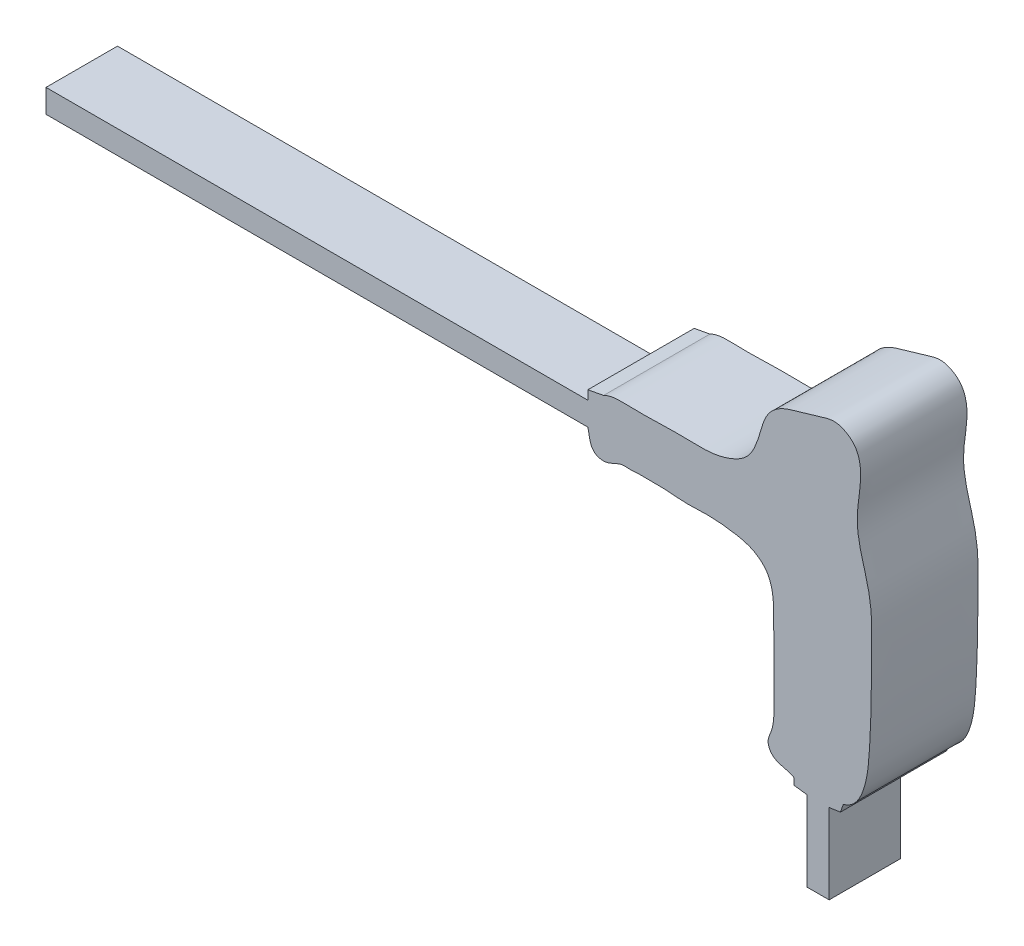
ISO-10303-21;
HEADER;
FILE_DESCRIPTION(('STEP AP214'),'2;1');
FILE_NAME('part.step','',(''),(''),'','','');
FILE_SCHEMA(('AUTOMOTIVE_DESIGN { 1 0 10303 214 1 1 1 1 }'));
ENDSEC;
DATA;
#1=APPLICATION_CONTEXT('core data for automotive mechanical design processes');
#2=APPLICATION_PROTOCOL_DEFINITION('international standard','automotive_design',2000,#1);
#3=PRODUCT_CONTEXT('',#1,'mechanical');
#4=PRODUCT('Part','Part','',(#3));
#5=PRODUCT_RELATED_PRODUCT_CATEGORY('part','',(#4));
#6=PRODUCT_DEFINITION_FORMATION('','',#4);
#7=PRODUCT_DEFINITION_CONTEXT('part definition',#1,'design');
#8=PRODUCT_DEFINITION('design','',#6,#7);
#9=PRODUCT_DEFINITION_SHAPE('','',#8);
#10=(LENGTH_UNIT() NAMED_UNIT(*) SI_UNIT(.MILLI.,.METRE.));
#11=(NAMED_UNIT(*) PLANE_ANGLE_UNIT() SI_UNIT($,.RADIAN.));
#12=(NAMED_UNIT(*) SI_UNIT($,.STERADIAN.) SOLID_ANGLE_UNIT());
#13=UNCERTAINTY_MEASURE_WITH_UNIT(LENGTH_MEASURE(1.E-05),#10,'distance_accuracy_value','');
#14=(GEOMETRIC_REPRESENTATION_CONTEXT(3) GLOBAL_UNCERTAINTY_ASSIGNED_CONTEXT((#13)) GLOBAL_UNIT_ASSIGNED_CONTEXT((#10,
#11,#12)) REPRESENTATION_CONTEXT('',''));
#15=CARTESIAN_POINT('',(0.,0.,0.));
#16=DIRECTION('',(0.,0.,1.));
#17=DIRECTION('',(1.,0.,0.));
#18=AXIS2_PLACEMENT_3D('',#15,#16,#17);
#19=CARTESIAN_POINT('',(132.530146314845,12.8255846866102,-8.7));
#20=DIRECTION('',(1.,0.,0.));
#21=DIRECTION('',(0.,0.,-1.));
#22=AXIS2_PLACEMENT_3D('',#19,#20,#21);
#23=PLANE('',#22);
#24=DIRECTION('',(0.,0.,1.));
#25=VECTOR('',#24,1.);
#26=CARTESIAN_POINT('',(132.530146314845,-0.274304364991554,-8.7));
#27=LINE('',#26,#25);
#28=CARTESIAN_POINT('',(132.530146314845,-0.274304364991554,-3.));
#29=VERTEX_POINT('',#28);
#30=CARTESIAN_POINT('',(132.530146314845,-0.274304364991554,8.7));
#31=VERTEX_POINT('',#30);
#32=EDGE_CURVE('E191',#29,#31,#27,.T.);
#33=ORIENTED_EDGE('',*,*,#32,.F.);
#34=DIRECTION('',(0.,-1.,0.));
#35=VECTOR('',#34,1.);
#36=CARTESIAN_POINT('',(132.530146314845,-0.274304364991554,-3.));
#37=LINE('',#36,#35);
#38=CARTESIAN_POINT('',(132.530146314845,12.8255846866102,-3.));
#39=VERTEX_POINT('',#38);
#40=EDGE_CURVE('E160',#39,#29,#37,.T.);
#41=ORIENTED_EDGE('',*,*,#40,.F.);
#42=DIRECTION('',(0.,0.,1.));
#43=VECTOR('',#42,1.);
#44=CARTESIAN_POINT('',(132.530146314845,12.8255846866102,-8.7));
#45=LINE('',#44,#43);
#46=CARTESIAN_POINT('',(132.530146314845,12.8255846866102,8.7));
#47=VERTEX_POINT('',#46);
#48=EDGE_CURVE('E390',#39,#47,#45,.T.);
#49=ORIENTED_EDGE('',*,*,#48,.T.);
#50=DIRECTION('',(0.,1.,0.));
#51=VECTOR('',#50,1.);
#52=CARTESIAN_POINT('',(132.530146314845,12.8255846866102,8.7));
#53=LINE('',#52,#51);
#54=EDGE_CURVE('E272',#31,#47,#53,.T.);
#55=ORIENTED_EDGE('',*,*,#54,.F.);
#56=EDGE_LOOP('',(#33,#41,#49,#55));
#57=FACE_BOUND('',#56,.T.);
#58=ADVANCED_FACE('F39',(#57),#23,.T.);
#59=CARTESIAN_POINT('',(132.530146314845,-0.274304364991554,-8.7));
#60=DIRECTION('',(0.,-1.,0.));
#61=DIRECTION('',(0.,0.,-1.));
#62=AXIS2_PLACEMENT_3D('',#59,#60,#61);
#63=PLANE('',#62);
#64=DIRECTION('',(0.,0.,1.));
#65=VECTOR('',#64,1.);
#66=CARTESIAN_POINT('',(128.905366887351,-0.274304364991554,-8.7));
#67=LINE('',#66,#65);
#68=CARTESIAN_POINT('',(128.905366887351,-0.274304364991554,-3.));
#69=VERTEX_POINT('',#68);
#70=CARTESIAN_POINT('',(128.905366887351,-0.274304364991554,8.7));
#71=VERTEX_POINT('',#70);
#72=EDGE_CURVE('E189',#69,#71,#67,.T.);
#73=ORIENTED_EDGE('',*,*,#72,.F.);
#74=DIRECTION('',(-1.,0.,0.));
#75=VECTOR('',#74,1.);
#76=CARTESIAN_POINT('',(128.905366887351,-0.274304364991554,-3.));
#77=LINE('',#76,#75);
#78=EDGE_CURVE('E167',#29,#69,#77,.T.);
#79=ORIENTED_EDGE('',*,*,#78,.F.);
#80=ORIENTED_EDGE('',*,*,#32,.T.);
#81=DIRECTION('',(1.,0.,0.));
#82=VECTOR('',#81,1.);
#83=CARTESIAN_POINT('',(132.530146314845,-0.274304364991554,8.7));
#84=LINE('',#83,#82);
#85=EDGE_CURVE('E268',#71,#31,#84,.T.);
#86=ORIENTED_EDGE('',*,*,#85,.F.);
#87=EDGE_LOOP('',(#73,#79,#80,#86));
#88=FACE_BOUND('',#87,.T.);
#89=ADVANCED_FACE('F339',(#88),#63,.T.);
#90=CARTESIAN_POINT('',(128.905366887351,-0.274304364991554,-8.7));
#91=DIRECTION('',(-1.,0.,0.));
#92=DIRECTION('',(0.,0.,1.));
#93=AXIS2_PLACEMENT_3D('',#90,#91,#92);
#94=PLANE('',#93);
#95=DIRECTION('',(0.,0.,1.));
#96=VECTOR('',#95,1.);
#97=CARTESIAN_POINT('',(128.905366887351,12.8255846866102,-8.7));
#98=LINE('',#97,#96);
#99=CARTESIAN_POINT('',(128.905366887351,12.8255846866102,-3.));
#100=VERTEX_POINT('',#99);
#101=CARTESIAN_POINT('',(128.905366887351,12.8255846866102,8.7));
#102=VERTEX_POINT('',#101);
#103=EDGE_CURVE('E174',#100,#102,#98,.T.);
#104=ORIENTED_EDGE('',*,*,#103,.F.);
#105=DIRECTION('',(0.,1.,0.));
#106=VECTOR('',#105,1.);
#107=CARTESIAN_POINT('',(128.905366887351,-0.274304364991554,-3.));
#108=LINE('',#107,#106);
#109=EDGE_CURVE('E161',#69,#100,#108,.T.);
#110=ORIENTED_EDGE('',*,*,#109,.F.);
#111=ORIENTED_EDGE('',*,*,#72,.T.);
#112=DIRECTION('',(0.,-1.,0.));
#113=VECTOR('',#112,1.);
#114=CARTESIAN_POINT('',(128.905366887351,-0.274304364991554,8.7));
#115=LINE('',#114,#113);
#116=EDGE_CURVE('E177',#102,#71,#115,.T.);
#117=ORIENTED_EDGE('',*,*,#116,.F.);
#118=EDGE_LOOP('',(#104,#110,#111,#117));
#119=FACE_BOUND('',#118,.T.);
#120=ADVANCED_FACE('F175',(#119),#94,.T.);
#121=CARTESIAN_POINT('',(93.0465953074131,50.8082638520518,-8.7));
#122=DIRECTION('',(-1.,0.,0.));
#123=DIRECTION('',(0.,0.,1.));
#124=AXIS2_PLACEMENT_3D('',#121,#122,#123);
#125=PLANE('',#124);
#126=DIRECTION('',(0.,-1.,0.));
#127=VECTOR('',#126,1.);
#128=CARTESIAN_POINT('',(93.0465953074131,50.8082638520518,-8.7));
#129=LINE('',#128,#127);
#130=CARTESIAN_POINT('',(93.0465953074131,52.2991390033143,-8.7));
#131=VERTEX_POINT('',#130);
#132=CARTESIAN_POINT('',(93.0465953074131,46.9889523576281,-8.7));
#133=VERTEX_POINT('',#132);
#134=EDGE_CURVE('E297',#131,#133,#129,.T.);
#135=ORIENTED_EDGE('',*,*,#134,.T.);
#136=DIRECTION('',(0.,0.,1.));
#137=VECTOR('',#136,1.);
#138=CARTESIAN_POINT('',(93.0465953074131,46.9889523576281,-8.7));
#139=LINE('',#138,#137);
#140=CARTESIAN_POINT('',(93.0465953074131,46.9889523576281,-3.));
#141=VERTEX_POINT('',#140);
#142=EDGE_CURVE('E200',#133,#141,#139,.T.);
#143=ORIENTED_EDGE('',*,*,#142,.T.);
#144=DIRECTION('',(0.,-1.,0.));
#145=VECTOR('',#144,1.);
#146=CARTESIAN_POINT('',(93.0465953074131,50.8082638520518,-3.));
#147=LINE('',#146,#145);
#148=CARTESIAN_POINT('',(93.0465953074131,50.8082638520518,-3.));
#149=VERTEX_POINT('',#148);
#150=EDGE_CURVE('E212',#149,#141,#147,.T.);
#151=ORIENTED_EDGE('',*,*,#150,.F.);
#152=DIRECTION('',(0.,0.,1.));
#153=VECTOR('',#152,1.);
#154=CARTESIAN_POINT('',(93.0465953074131,50.8082638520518,-8.7));
#155=LINE('',#154,#153);
#156=CARTESIAN_POINT('',(93.0465953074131,50.8082638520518,8.7));
#157=VERTEX_POINT('',#156);
#158=EDGE_CURVE('E552',#149,#157,#155,.T.);
#159=ORIENTED_EDGE('',*,*,#158,.T.);
#160=DIRECTION('',(0.,-1.,0.));
#161=VECTOR('',#160,1.);
#162=CARTESIAN_POINT('',(93.0465953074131,50.8082638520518,8.7));
#163=LINE('',#162,#161);
#164=CARTESIAN_POINT('',(93.0465953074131,52.2991390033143,8.7));
#165=VERTEX_POINT('',#164);
#166=EDGE_CURVE('E234',#165,#157,#163,.T.);
#167=ORIENTED_EDGE('',*,*,#166,.F.);
#168=DIRECTION('',(0.,0.,1.));
#169=VECTOR('',#168,1.);
#170=CARTESIAN_POINT('',(93.0465953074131,52.2991390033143,-8.7));
#171=LINE('',#170,#169);
#172=EDGE_CURVE('E11',#131,#165,#171,.T.);
#173=ORIENTED_EDGE('',*,*,#172,.F.);
#174=EDGE_LOOP('',(#135,#143,#151,#159,#167,#173));
#175=FACE_BOUND('',#174,.T.);
#176=ADVANCED_FACE('F41',(#175),#125,.T.);
#177=CARTESIAN_POINT('',(93.0465953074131,52.2991390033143,-8.7));
#178=DIRECTION('',(-0.182542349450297,0.983197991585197,0.));
#179=DIRECTION('',(-0.983197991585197,-0.182542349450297,0.));
#180=AXIS2_PLACEMENT_3D('',#177,#178,#179);
#181=PLANE('',#180);
#182=ORIENTED_EDGE('',*,*,#172,.T.);
#183=DIRECTION('',(-0.983197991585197,-0.182542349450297,0.));
#184=VECTOR('',#183,1.);
#185=CARTESIAN_POINT('',(93.0465953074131,52.2991390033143,8.7));
#186=LINE('',#185,#184);
#187=CARTESIAN_POINT('',(95.6109997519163,52.7752510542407,8.7));
#188=VERTEX_POINT('',#187);
#189=EDGE_CURVE('E290',#188,#165,#186,.T.);
#190=ORIENTED_EDGE('',*,*,#189,.F.);
#191=DIRECTION('',(0.,0.,1.));
#192=VECTOR('',#191,1.);
#193=CARTESIAN_POINT('',(95.6109997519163,52.7752510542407,-8.7));
#194=LINE('',#193,#192);
#195=CARTESIAN_POINT('',(95.6109997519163,52.7752510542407,-8.7));
#196=VERTEX_POINT('',#195);
#197=EDGE_CURVE('E49',#196,#188,#194,.T.);
#198=ORIENTED_EDGE('',*,*,#197,.F.);
#199=DIRECTION('',(-0.983197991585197,-0.182542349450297,0.));
#200=VECTOR('',#199,1.);
#201=CARTESIAN_POINT('',(93.0465953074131,52.2991390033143,-8.7));
#202=LINE('',#201,#200);
#203=EDGE_CURVE('E406',#196,#131,#202,.T.);
#204=ORIENTED_EDGE('',*,*,#203,.T.);
#205=EDGE_LOOP('',(#182,#190,#198,#204));
#206=FACE_BOUND('',#205,.T.);
#207=ADVANCED_FACE('F413',(#206),#181,.T.);
#208=CARTESIAN_POINT('',(134.848525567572,14.440362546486,-8.7));
#209=CARTESIAN_POINT('',(136.736418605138,14.9231028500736,-8.7));
#210=CARTESIAN_POINT('',(138.623598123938,18.4056818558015,-8.7));
#211=CARTESIAN_POINT('',(139.100680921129,23.2563938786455,-8.7));
#212=CARTESIAN_POINT('',(139.320359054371,27.9325311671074,-8.7));
#213=CARTESIAN_POINT('',(139.444391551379,31.9067017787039,-8.7));
#214=CARTESIAN_POINT('',(139.496456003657,35.6067360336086,-8.7));
#215=CARTESIAN_POINT('',(139.468211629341,39.4871015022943,-8.7));
#216=CARTESIAN_POINT('',(139.592453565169,43.3374849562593,-8.7));
#217=CARTESIAN_POINT('',(138.865216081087,47.8353164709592,-8.7));
#218=CARTESIAN_POINT('',(137.632338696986,51.5474413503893,-8.7));
#219=CARTESIAN_POINT('',(137.045514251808,55.201682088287,-8.7));
#220=CARTESIAN_POINT('',(137.241655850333,58.4165321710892,-8.7));
#221=CARTESIAN_POINT('',(137.7295378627,61.2582600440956,-8.7));
#222=CARTESIAN_POINT('',(137.710800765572,64.0220703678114,-8.7));
#223=CARTESIAN_POINT('',(136.95698982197,66.2019911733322,-8.7));
#224=CARTESIAN_POINT('',(135.406949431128,67.4316193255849,-8.7));
#225=CARTESIAN_POINT('',(133.228213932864,68.2713814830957,-8.7));
#226=CARTESIAN_POINT('',(130.144484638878,67.0579983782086,-8.7));
#227=CARTESIAN_POINT('',(126.755424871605,66.3552633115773,-8.7));
#228=CARTESIAN_POINT('',(123.763996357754,65.1154411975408,-8.7));
#229=CARTESIAN_POINT('',(122.085552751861,63.1402459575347,-8.7));
#230=CARTESIAN_POINT('',(121.332411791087,60.6562044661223,-8.7));
#231=CARTESIAN_POINT('',(120.606811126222,58.1322659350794,-8.7));
#232=CARTESIAN_POINT('',(119.154303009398,55.5654643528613,-8.7));
#233=CARTESIAN_POINT('',(116.520614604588,54.1283674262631,-8.7));
#234=CARTESIAN_POINT('',(113.776029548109,53.4373210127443,-8.7));
#235=CARTESIAN_POINT('',(111.067538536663,53.3382037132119,-8.7));
#236=CARTESIAN_POINT('',(108.109736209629,53.4571462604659,-8.7));
#237=CARTESIAN_POINT('',(104.586961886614,53.3764639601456,-8.7));
#238=CARTESIAN_POINT('',(101.462662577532,53.2757603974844,-8.7));
#239=CARTESIAN_POINT('',(98.4573744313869,53.4141349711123,-8.7));
#240=CARTESIAN_POINT('',(96.6821018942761,53.3519944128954,-8.7));
#241=CARTESIAN_POINT('',(95.6109997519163,52.7752510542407,-8.7));
#242=B_SPLINE_CURVE_WITH_KNOTS('',3,(#208,#209,#210,#211,#212,#213,#214,#215,#216,#217,#218,
#219,#220,#221,#222,#223,#224,#225,#226,#227,#228,#229,#230,#231,#232,#233,#234,#235,#236,#237,
#238,#239,#240,#241),.UNSPECIFIED.,.F.,.F.,(4,1,1,1,1,1,1,1,1,1,1,1,1,1,1,1,1,1,1,1,1,1,1,1,1,1,
1,1,1,1,1,4),(0.,0.0523924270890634,0.10750471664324,0.143602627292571,0.18989517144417,
0.22440272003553,0.252343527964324,0.304008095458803,0.337268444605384,0.385616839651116,
0.418863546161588,0.445230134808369,0.479903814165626,0.503452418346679,0.526173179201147,
0.544610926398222,0.559970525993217,0.592568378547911,0.635826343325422,0.664197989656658,
0.685191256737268,0.709577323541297,0.73964049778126,0.762776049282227,0.793903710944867,
0.824225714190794,0.845716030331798,0.873243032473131,0.911265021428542,0.949287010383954,
0.964921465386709,1.),.UNSPECIFIED.);
#243=DIRECTION('',(0.,0.,1.));
#244=VECTOR('',#243,1.);
#245=SURFACE_OF_LINEAR_EXTRUSION('',#242,#244);
#246=ORIENTED_EDGE('',*,*,#197,.T.);
#247=CARTESIAN_POINT('',(134.848525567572,14.440362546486,8.7));
#248=CARTESIAN_POINT('',(136.736418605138,14.9231028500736,8.7));
#249=CARTESIAN_POINT('',(138.623598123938,18.4056818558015,8.7));
#250=CARTESIAN_POINT('',(139.100680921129,23.2563938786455,8.7));
#251=CARTESIAN_POINT('',(139.320359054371,27.9325311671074,8.7));
#252=CARTESIAN_POINT('',(139.444391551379,31.9067017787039,8.7));
#253=CARTESIAN_POINT('',(139.496456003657,35.6067360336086,8.7));
#254=CARTESIAN_POINT('',(139.468211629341,39.4871015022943,8.7));
#255=CARTESIAN_POINT('',(139.592453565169,43.3374849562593,8.7));
#256=CARTESIAN_POINT('',(138.865216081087,47.8353164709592,8.7));
#257=CARTESIAN_POINT('',(137.632338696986,51.5474413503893,8.7));
#258=CARTESIAN_POINT('',(137.045514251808,55.201682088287,8.7));
#259=CARTESIAN_POINT('',(137.241655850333,58.4165321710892,8.7));
#260=CARTESIAN_POINT('',(137.7295378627,61.2582600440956,8.7));
#261=CARTESIAN_POINT('',(137.710800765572,64.0220703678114,8.7));
#262=CARTESIAN_POINT('',(136.95698982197,66.2019911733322,8.7));
#263=CARTESIAN_POINT('',(135.406949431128,67.4316193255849,8.7));
#264=CARTESIAN_POINT('',(133.228213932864,68.2713814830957,8.7));
#265=CARTESIAN_POINT('',(130.144484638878,67.0579983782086,8.7));
#266=CARTESIAN_POINT('',(126.755424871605,66.3552633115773,8.7));
#267=CARTESIAN_POINT('',(123.763996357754,65.1154411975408,8.7));
#268=CARTESIAN_POINT('',(122.085552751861,63.1402459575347,8.7));
#269=CARTESIAN_POINT('',(121.332411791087,60.6562044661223,8.7));
#270=CARTESIAN_POINT('',(120.606811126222,58.1322659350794,8.7));
#271=CARTESIAN_POINT('',(119.154303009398,55.5654643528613,8.7));
#272=CARTESIAN_POINT('',(116.520614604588,54.1283674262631,8.7));
#273=CARTESIAN_POINT('',(113.776029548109,53.4373210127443,8.7));
#274=CARTESIAN_POINT('',(111.067538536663,53.3382037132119,8.7));
#275=CARTESIAN_POINT('',(108.109736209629,53.4571462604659,8.7));
#276=CARTESIAN_POINT('',(104.586961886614,53.3764639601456,8.7));
#277=CARTESIAN_POINT('',(101.462662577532,53.2757603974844,8.7));
#278=CARTESIAN_POINT('',(98.4573744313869,53.4141349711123,8.7));
#279=CARTESIAN_POINT('',(96.6821018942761,53.3519944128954,8.7));
#280=CARTESIAN_POINT('',(95.6109997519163,52.7752510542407,8.7));
#281=B_SPLINE_CURVE_WITH_KNOTS('',3,(#247,#248,#249,#250,#251,#252,#253,#254,#255,#256,#257,
#258,#259,#260,#261,#262,#263,#264,#265,#266,#267,#268,#269,#270,#271,#272,#273,#274,#275,#276,
#277,#278,#279,#280),.UNSPECIFIED.,.F.,.F.,(4,1,1,1,1,1,1,1,1,1,1,1,1,1,1,1,1,1,1,1,1,1,1,1,1,1,
1,1,1,1,1,4),(0.,0.0523924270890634,0.10750471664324,0.143602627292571,0.18989517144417,
0.22440272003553,0.252343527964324,0.304008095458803,0.337268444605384,0.385616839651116,
0.418863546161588,0.445230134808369,0.479903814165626,0.503452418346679,0.526173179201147,
0.544610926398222,0.559970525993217,0.592568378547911,0.635826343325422,0.664197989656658,
0.685191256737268,0.709577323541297,0.73964049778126,0.762776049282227,0.793903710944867,
0.824225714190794,0.845716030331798,0.873243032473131,0.911265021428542,0.949287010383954,
0.964921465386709,1.),.UNSPECIFIED.);
#282=CARTESIAN_POINT('',(134.848525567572,14.440362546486,8.7));
#283=VERTEX_POINT('',#282);
#284=EDGE_CURVE('E284',#283,#188,#281,.T.);
#285=ORIENTED_EDGE('',*,*,#284,.F.);
#286=DIRECTION('',(0.,0.,1.));
#287=VECTOR('',#286,1.);
#288=CARTESIAN_POINT('',(134.848525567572,14.440362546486,-8.7));
#289=LINE('',#288,#287);
#290=CARTESIAN_POINT('',(134.848525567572,14.440362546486,-8.7));
#291=VERTEX_POINT('',#290);
#292=EDGE_CURVE('E376',#291,#283,#289,.T.);
#293=ORIENTED_EDGE('',*,*,#292,.F.);
#294=EDGE_CURVE('E398',#291,#196,#242,.T.);
#295=ORIENTED_EDGE('',*,*,#294,.T.);
#296=EDGE_LOOP('',(#246,#285,#293,#295));
#297=FACE_BOUND('',#296,.T.);
#298=ADVANCED_FACE('F364',(#297),#245,.T.);
#299=CARTESIAN_POINT('',(134.848525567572,14.440362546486,-8.7));
#300=DIRECTION('',(0.944419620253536,-0.328742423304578,0.));
#301=DIRECTION('',(0.328742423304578,0.944419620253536,0.));
#302=AXIS2_PLACEMENT_3D('',#299,#300,#301);
#303=PLANE('',#302);
#304=ORIENTED_EDGE('',*,*,#292,.T.);
#305=DIRECTION('',(0.328742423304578,0.944419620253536,0.));
#306=VECTOR('',#305,1.);
#307=CARTESIAN_POINT('',(134.848525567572,14.440362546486,8.7));
#308=LINE('',#307,#306);
#309=CARTESIAN_POINT('',(134.379617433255,13.0932712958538,8.7));
#310=VERTEX_POINT('',#309);
#311=EDGE_CURVE('E280',#310,#283,#308,.T.);
#312=ORIENTED_EDGE('',*,*,#311,.F.);
#313=DIRECTION('',(0.,0.,1.));
#314=VECTOR('',#313,1.);
#315=CARTESIAN_POINT('',(134.379617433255,13.0932712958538,-8.7));
#316=LINE('',#315,#314);
#317=CARTESIAN_POINT('',(134.379617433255,13.0932712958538,-8.7));
#318=VERTEX_POINT('',#317);
#319=EDGE_CURVE('E368',#318,#310,#316,.T.);
#320=ORIENTED_EDGE('',*,*,#319,.F.);
#321=DIRECTION('',(0.328742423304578,0.944419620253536,0.));
#322=VECTOR('',#321,1.);
#323=CARTESIAN_POINT('',(134.848525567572,14.440362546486,-8.7));
#324=LINE('',#323,#322);
#325=EDGE_CURVE('E381',#318,#291,#324,.T.);
#326=ORIENTED_EDGE('',*,*,#325,.T.);
#327=EDGE_LOOP('',(#304,#312,#320,#326));
#328=FACE_BOUND('',#327,.T.);
#329=ADVANCED_FACE('F359',(#328),#303,.T.);
#330=CARTESIAN_POINT('',(134.379617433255,13.0932712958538,-8.7));
#331=DIRECTION('',(0.143244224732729,-0.989687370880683,0.));
#332=DIRECTION('',(0.989687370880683,0.143244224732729,0.));
#333=AXIS2_PLACEMENT_3D('',#330,#331,#332);
#334=PLANE('',#333);
#335=ORIENTED_EDGE('',*,*,#319,.T.);
#336=DIRECTION('',(0.989687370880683,0.143244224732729,0.));
#337=VECTOR('',#336,1.);
#338=CARTESIAN_POINT('',(134.379617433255,13.0932712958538,8.7));
#339=LINE('',#338,#337);
#340=EDGE_CURVE('E276',#47,#310,#339,.T.);
#341=ORIENTED_EDGE('',*,*,#340,.F.);
#342=ORIENTED_EDGE('',*,*,#48,.F.);
#343=CARTESIAN_POINT('',(132.530146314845,12.8255846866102,-8.7));
#344=VERTEX_POINT('',#343);
#345=EDGE_CURVE('E156',#344,#39,#45,.T.);
#346=ORIENTED_EDGE('',*,*,#345,.F.);
#347=DIRECTION('',(0.989687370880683,0.143244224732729,0.));
#348=VECTOR('',#347,1.);
#349=CARTESIAN_POINT('',(134.379617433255,13.0932712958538,-8.7));
#350=LINE('',#349,#348);
#351=EDGE_CURVE('E371',#344,#318,#350,.T.);
#352=ORIENTED_EDGE('',*,*,#351,.T.);
#353=EDGE_LOOP('',(#335,#341,#342,#346,#352));
#354=FACE_BOUND('',#353,.T.);
#355=ADVANCED_FACE('F349',(#354),#334,.T.);
#356=CARTESIAN_POINT('',(128.905366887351,12.8255846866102,-8.7));
#357=DIRECTION('',(-0.124215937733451,-0.992255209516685,0.));
#358=DIRECTION('',(0.992255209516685,-0.124215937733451,0.));
#359=AXIS2_PLACEMENT_3D('',#356,#357,#358);
#360=PLANE('',#359);
#361=CARTESIAN_POINT('',(128.905366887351,12.8255846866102,-8.7));
#362=VERTEX_POINT('',#361);
#363=EDGE_CURVE('E153',#362,#100,#98,.T.);
#364=ORIENTED_EDGE('',*,*,#363,.T.);
#365=ORIENTED_EDGE('',*,*,#103,.T.);
#366=DIRECTION('',(0.992255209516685,-0.124215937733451,0.));
#367=VECTOR('',#366,1.);
#368=CARTESIAN_POINT('',(128.905366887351,12.8255846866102,8.7));
#369=LINE('',#368,#367);
#370=CARTESIAN_POINT('',(126.767046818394,13.0932712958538,8.7));
#371=VERTEX_POINT('',#370);
#372=EDGE_CURVE('E263',#371,#102,#369,.T.);
#373=ORIENTED_EDGE('',*,*,#372,.F.);
#374=DIRECTION('',(0.,0.,1.));
#375=VECTOR('',#374,1.);
#376=CARTESIAN_POINT('',(126.767046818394,13.0932712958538,-8.7));
#377=LINE('',#376,#375);
#378=CARTESIAN_POINT('',(126.767046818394,13.0932712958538,-8.7));
#379=VERTEX_POINT('',#378);
#380=EDGE_CURVE('E182',#379,#371,#377,.T.);
#381=ORIENTED_EDGE('',*,*,#380,.F.);
#382=DIRECTION('',(0.992255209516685,-0.124215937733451,0.));
#383=VECTOR('',#382,1.);
#384=CARTESIAN_POINT('',(128.905366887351,12.8255846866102,-8.7));
#385=LINE('',#384,#383);
#386=EDGE_CURVE('E187',#379,#362,#385,.T.);
#387=ORIENTED_EDGE('',*,*,#386,.T.);
#388=EDGE_LOOP('',(#364,#365,#373,#381,#387));
#389=FACE_BOUND('',#388,.T.);
#390=ADVANCED_FACE('F185',(#389),#360,.T.);
#391=CARTESIAN_POINT('',(126.767046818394,13.0932712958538,-8.7));
#392=DIRECTION('',(-1.,0.,0.));
#393=DIRECTION('',(0.,0.,1.));
#394=AXIS2_PLACEMENT_3D('',#391,#392,#393);
#395=PLANE('',#394);
#396=ORIENTED_EDGE('',*,*,#380,.T.);
#397=DIRECTION('',(0.,-1.,0.));
#398=VECTOR('',#397,1.);
#399=CARTESIAN_POINT('',(126.767046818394,13.0932712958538,8.7));
#400=LINE('',#399,#398);
#401=CARTESIAN_POINT('',(126.767046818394,14.1854062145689,8.7));
#402=VERTEX_POINT('',#401);
#403=EDGE_CURVE('E256',#402,#371,#400,.T.);
#404=ORIENTED_EDGE('',*,*,#403,.F.);
#405=DIRECTION('',(0.,0.,1.));
#406=VECTOR('',#405,1.);
#407=CARTESIAN_POINT('',(126.767046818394,14.1854062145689,-8.7));
#408=LINE('',#407,#406);
#409=CARTESIAN_POINT('',(126.767046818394,14.1854062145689,-8.7));
#410=VERTEX_POINT('',#409);
#411=EDGE_CURVE('E197',#410,#402,#408,.T.);
#412=ORIENTED_EDGE('',*,*,#411,.F.);
#413=DIRECTION('',(0.,-1.,0.));
#414=VECTOR('',#413,1.);
#415=CARTESIAN_POINT('',(126.767046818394,13.0932712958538,-8.7));
#416=LINE('',#415,#414);
#417=EDGE_CURVE('E307',#410,#379,#416,.T.);
#418=ORIENTED_EDGE('',*,*,#417,.T.);
#419=EDGE_LOOP('',(#396,#404,#412,#418));
#420=FACE_BOUND('',#419,.T.);
#421=ADVANCED_FACE('F318',(#420),#395,.T.);
#422=CARTESIAN_POINT('',(93.0465953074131,46.9889523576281,-8.7));
#423=CARTESIAN_POINT('',(93.2474335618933,46.0738351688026,-8.7));
#424=CARTESIAN_POINT('',(93.3333036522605,43.9529703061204,-8.7));
#425=CARTESIAN_POINT('',(95.699523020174,43.2942738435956,-8.7));
#426=CARTESIAN_POINT('',(97.1744860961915,43.8945644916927,-8.7));
#427=CARTESIAN_POINT('',(98.5171056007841,44.5834920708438,-8.7));
#428=CARTESIAN_POINT('',(99.7972512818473,44.4113846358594,-8.7));
#429=CARTESIAN_POINT('',(101.264185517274,44.5661234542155,-8.7));
#430=CARTESIAN_POINT('',(103.261635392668,44.4789691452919,-8.7));
#431=CARTESIAN_POINT('',(105.936500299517,44.5619987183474,-8.7));
#432=CARTESIAN_POINT('',(108.675461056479,44.184987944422,-8.7));
#433=CARTESIAN_POINT('',(111.422540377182,44.3526383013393,-8.7));
#434=CARTESIAN_POINT('',(114.114693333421,44.349958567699,-8.7));
#435=CARTESIAN_POINT('',(117.004597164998,43.989657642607,-8.7));
#436=CARTESIAN_POINT('',(120.078216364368,43.3478136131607,-8.7));
#437=CARTESIAN_POINT('',(122.538705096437,41.3650784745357,-8.7));
#438=CARTESIAN_POINT('',(123.374576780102,38.5275988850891,-8.7));
#439=CARTESIAN_POINT('',(123.511262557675,35.5289785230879,-8.7));
#440=CARTESIAN_POINT('',(123.401119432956,32.5481133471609,-8.7));
#441=CARTESIAN_POINT('',(123.583566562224,29.8019446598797,-8.7));
#442=CARTESIAN_POINT('',(123.48681446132,27.7999356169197,-8.7));
#443=CARTESIAN_POINT('',(123.514838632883,25.8508589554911,-8.7));
#444=CARTESIAN_POINT('',(123.524766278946,23.6761082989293,-8.7));
#445=CARTESIAN_POINT('',(123.544853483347,21.2433195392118,-8.7));
#446=CARTESIAN_POINT('',(123.217470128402,19.0339415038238,-8.7));
#447=CARTESIAN_POINT('',(122.45882498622,17.6153390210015,-8.7));
#448=CARTESIAN_POINT('',(122.621061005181,16.3744604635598,-8.7));
#449=CARTESIAN_POINT('',(123.806626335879,14.7112198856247,-8.7));
#450=CARTESIAN_POINT('',(125.787848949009,14.8183473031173,-8.7));
#451=CARTESIAN_POINT('',(126.767046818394,14.1854062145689,-8.7));
#452=B_SPLINE_CURVE_WITH_KNOTS('',3,(#422,#423,#424,#425,#426,#427,#428,#429,#430,#431,#432,
#433,#434,#435,#436,#437,#438,#439,#440,#441,#442,#443,#444,#445,#446,#447,#448,#449,#450,#451),
.UNSPECIFIED.,.F.,.F.,(4,1,1,1,1,1,1,1,1,1,1,1,1,1,1,1,1,1,1,1,1,1,1,1,1,1,1,4),(0.,
0.0522148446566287,0.0772754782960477,0.104597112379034,0.127834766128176,0.147881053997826,
0.164899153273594,0.198890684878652,0.243779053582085,0.293581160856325,0.331207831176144,
0.375957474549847,0.422905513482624,0.47127116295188,0.525960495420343,0.564059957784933,
0.609940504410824,0.670320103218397,0.707430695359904,0.742198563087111,0.766656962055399,
0.801215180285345,0.846864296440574,0.883643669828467,0.907872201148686,0.921373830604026,
0.941822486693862,1.),.UNSPECIFIED.);
#453=DIRECTION('',(0.,0.,1.));
#454=VECTOR('',#453,1.);
#455=SURFACE_OF_LINEAR_EXTRUSION('',#452,#454);
#456=ORIENTED_EDGE('',*,*,#411,.T.);
#457=CARTESIAN_POINT('',(93.0465953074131,46.9889523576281,8.7));
#458=CARTESIAN_POINT('',(93.2474335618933,46.0738351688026,8.7));
#459=CARTESIAN_POINT('',(93.3333036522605,43.9529703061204,8.7));
#460=CARTESIAN_POINT('',(95.699523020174,43.2942738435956,8.7));
#461=CARTESIAN_POINT('',(97.1744860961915,43.8945644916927,8.7));
#462=CARTESIAN_POINT('',(98.5171056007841,44.5834920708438,8.7));
#463=CARTESIAN_POINT('',(99.7972512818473,44.4113846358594,8.7));
#464=CARTESIAN_POINT('',(101.264185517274,44.5661234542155,8.7));
#465=CARTESIAN_POINT('',(103.261635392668,44.4789691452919,8.7));
#466=CARTESIAN_POINT('',(105.936500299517,44.5619987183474,8.7));
#467=CARTESIAN_POINT('',(108.675461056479,44.184987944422,8.7));
#468=CARTESIAN_POINT('',(111.422540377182,44.3526383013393,8.7));
#469=CARTESIAN_POINT('',(114.114693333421,44.349958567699,8.7));
#470=CARTESIAN_POINT('',(117.004597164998,43.989657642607,8.7));
#471=CARTESIAN_POINT('',(120.078216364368,43.3478136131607,8.7));
#472=CARTESIAN_POINT('',(122.538705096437,41.3650784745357,8.7));
#473=CARTESIAN_POINT('',(123.374576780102,38.5275988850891,8.7));
#474=CARTESIAN_POINT('',(123.511262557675,35.5289785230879,8.7));
#475=CARTESIAN_POINT('',(123.401119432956,32.5481133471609,8.7));
#476=CARTESIAN_POINT('',(123.583566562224,29.8019446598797,8.7));
#477=CARTESIAN_POINT('',(123.48681446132,27.7999356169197,8.7));
#478=CARTESIAN_POINT('',(123.514838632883,25.8508589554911,8.7));
#479=CARTESIAN_POINT('',(123.524766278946,23.6761082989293,8.7));
#480=CARTESIAN_POINT('',(123.544853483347,21.2433195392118,8.7));
#481=CARTESIAN_POINT('',(123.217470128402,19.0339415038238,8.7));
#482=CARTESIAN_POINT('',(122.45882498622,17.6153390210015,8.7));
#483=CARTESIAN_POINT('',(122.621061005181,16.3744604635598,8.7));
#484=CARTESIAN_POINT('',(123.806626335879,14.7112198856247,8.7));
#485=CARTESIAN_POINT('',(125.787848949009,14.8183473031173,8.7));
#486=CARTESIAN_POINT('',(126.767046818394,14.1854062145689,8.7));
#487=B_SPLINE_CURVE_WITH_KNOTS('',3,(#457,#458,#459,#460,#461,#462,#463,#464,#465,#466,#467,
#468,#469,#470,#471,#472,#473,#474,#475,#476,#477,#478,#479,#480,#481,#482,#483,#484,#485,#486),
.UNSPECIFIED.,.F.,.F.,(4,1,1,1,1,1,1,1,1,1,1,1,1,1,1,1,1,1,1,1,1,1,1,1,1,1,1,4),(0.,
0.0522148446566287,0.0772754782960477,0.104597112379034,0.127834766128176,0.147881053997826,
0.164899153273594,0.198890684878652,0.243779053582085,0.293581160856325,0.331207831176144,
0.375957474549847,0.422905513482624,0.47127116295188,0.525960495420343,0.564059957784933,
0.609940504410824,0.670320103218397,0.707430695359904,0.742198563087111,0.766656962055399,
0.801215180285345,0.846864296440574,0.883643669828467,0.907872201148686,0.921373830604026,
0.941822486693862,1.),.UNSPECIFIED.);
#488=CARTESIAN_POINT('',(93.0465953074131,46.9889523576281,8.7));
#489=VERTEX_POINT('',#488);
#490=EDGE_CURVE('E250',#489,#402,#487,.T.);
#491=ORIENTED_EDGE('',*,*,#490,.F.);
#492=EDGE_CURVE('E207',#141,#489,#139,.T.);
#493=ORIENTED_EDGE('',*,*,#492,.F.);
#494=ORIENTED_EDGE('',*,*,#142,.F.);
#495=EDGE_CURVE('E300',#133,#410,#452,.T.);
#496=ORIENTED_EDGE('',*,*,#495,.T.);
#497=EDGE_LOOP('',(#456,#491,#493,#494,#496));
#498=FACE_BOUND('',#497,.T.);
#499=ADVANCED_FACE('F313',(#498),#455,.T.);
#500=CARTESIAN_POINT('',(4.35276685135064,46.9889523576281,-8.7));
#501=DIRECTION('',(0.,-1.,0.));
#502=DIRECTION('',(0.,0.,-1.));
#503=AXIS2_PLACEMENT_3D('',#500,#501,#502);
#504=PLANE('',#503);
#505=DIRECTION('',(-1.,0.,0.));
#506=VECTOR('',#505,1.);
#507=CARTESIAN_POINT('',(4.35276685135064,46.9889523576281,-3.));
#508=LINE('',#507,#506);
#509=CARTESIAN_POINT('',(4.35276685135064,46.9889523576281,-3.));
#510=VERTEX_POINT('',#509);
#511=EDGE_CURVE('E216',#141,#510,#508,.T.);
#512=ORIENTED_EDGE('',*,*,#511,.F.);
#513=ORIENTED_EDGE('',*,*,#492,.T.);
#514=DIRECTION('',(1.,0.,0.));
#515=VECTOR('',#514,1.);
#516=CARTESIAN_POINT('',(4.35276685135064,46.9889523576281,8.7));
#517=LINE('',#516,#515);
#518=CARTESIAN_POINT('',(4.35276685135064,46.9889523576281,8.7));
#519=VERTEX_POINT('',#518);
#520=EDGE_CURVE('E246',#519,#489,#517,.T.);
#521=ORIENTED_EDGE('',*,*,#520,.F.);
#522=DIRECTION('',(0.,0.,1.));
#523=VECTOR('',#522,1.);
#524=CARTESIAN_POINT('',(4.35276685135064,46.9889523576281,-8.7));
#525=LINE('',#524,#523);
#526=EDGE_CURVE('E203',#510,#519,#525,.T.);
#527=ORIENTED_EDGE('',*,*,#526,.F.);
#528=EDGE_LOOP('',(#512,#513,#521,#527));
#529=FACE_BOUND('',#528,.T.);
#530=ADVANCED_FACE('F317',(#529),#504,.T.);
#531=CARTESIAN_POINT('',(4.35276685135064,50.8082638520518,-8.7));
#532=DIRECTION('',(-1.,0.,0.));
#533=DIRECTION('',(0.,-1.,0.));
#534=AXIS2_PLACEMENT_3D('',#531,#532,#533);
#535=PLANE('',#534);
#536=DIRECTION('',(0.,1.,0.));
#537=VECTOR('',#536,1.);
#538=CARTESIAN_POINT('',(4.35276685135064,50.8082638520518,-3.));
#539=LINE('',#538,#537);
#540=CARTESIAN_POINT('',(4.35276685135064,50.8082638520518,-3.));
#541=VERTEX_POINT('',#540);
#542=EDGE_CURVE('E228',#510,#541,#539,.T.);
#543=ORIENTED_EDGE('',*,*,#542,.F.);
#544=ORIENTED_EDGE('',*,*,#526,.T.);
#545=DIRECTION('',(0.,-1.,0.));
#546=VECTOR('',#545,1.);
#547=CARTESIAN_POINT('',(4.35276685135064,50.8082638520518,8.7));
#548=LINE('',#547,#546);
#549=CARTESIAN_POINT('',(4.35276685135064,50.8082638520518,8.7));
#550=VERTEX_POINT('',#549);
#551=EDGE_CURVE('E242',#550,#519,#548,.T.);
#552=ORIENTED_EDGE('',*,*,#551,.F.);
#553=DIRECTION('',(0.,0.,1.));
#554=VECTOR('',#553,1.);
#555=CARTESIAN_POINT('',(4.35276685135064,50.8082638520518,-8.7));
#556=LINE('',#555,#554);
#557=EDGE_CURVE('E550',#541,#550,#556,.T.);
#558=ORIENTED_EDGE('',*,*,#557,.F.);
#559=EDGE_LOOP('',(#543,#544,#552,#558));
#560=FACE_BOUND('',#559,.T.);
#561=ADVANCED_FACE('F323',(#560),#535,.T.);
#562=CARTESIAN_POINT('',(93.0465953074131,50.8082638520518,-8.7));
#563=DIRECTION('',(0.,1.,0.));
#564=DIRECTION('',(-1.,0.,0.));
#565=AXIS2_PLACEMENT_3D('',#562,#563,#564);
#566=PLANE('',#565);
#567=DIRECTION('',(1.,0.,0.));
#568=VECTOR('',#567,1.);
#569=CARTESIAN_POINT('',(4.35276685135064,50.8082638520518,-3.));
#570=LINE('',#569,#568);
#571=EDGE_CURVE('E217',#541,#149,#570,.T.);
#572=ORIENTED_EDGE('',*,*,#571,.F.);
#573=ORIENTED_EDGE('',*,*,#557,.T.);
#574=DIRECTION('',(-1.,0.,0.));
#575=VECTOR('',#574,1.);
#576=CARTESIAN_POINT('',(93.0465953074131,50.8082638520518,8.7));
#577=LINE('',#576,#575);
#578=EDGE_CURVE('E238',#157,#550,#577,.T.);
#579=ORIENTED_EDGE('',*,*,#578,.F.);
#580=ORIENTED_EDGE('',*,*,#158,.F.);
#581=EDGE_LOOP('',(#572,#573,#579,#580));
#582=FACE_BOUND('',#581,.T.);
#583=ADVANCED_FACE('F326',(#582),#566,.T.);
#584=CARTESIAN_POINT('',(137.627776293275,63.6933067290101,-8.7));
#585=DIRECTION('',(0.,0.,1.));
#586=DIRECTION('',(1.,0.,0.));
#587=AXIS2_PLACEMENT_3D('',#584,#585,#586);
#588=PLANE('',#587);
#589=ORIENTED_EDGE('',*,*,#351,.F.);
#590=DIRECTION('',(1.,0.,0.));
#591=VECTOR('',#590,1.);
#592=CARTESIAN_POINT('',(128.905366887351,12.8255846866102,-8.7));
#593=LINE('',#592,#591);
#594=EDGE_CURVE('E171',#362,#344,#593,.T.);
#595=ORIENTED_EDGE('',*,*,#594,.F.);
#596=ORIENTED_EDGE('',*,*,#386,.F.);
#597=ORIENTED_EDGE('',*,*,#417,.F.);
#598=ORIENTED_EDGE('',*,*,#495,.F.);
#599=ORIENTED_EDGE('',*,*,#134,.F.);
#600=ORIENTED_EDGE('',*,*,#203,.F.);
#601=ORIENTED_EDGE('',*,*,#294,.F.);
#602=ORIENTED_EDGE('',*,*,#325,.F.);
#603=EDGE_LOOP('',(#589,#595,#596,#597,#598,#599,#600,#601,#602));
#604=FACE_BOUND('',#603,.T.);
#605=ADVANCED_FACE('F329',(#604),#588,.F.);
#606=CARTESIAN_POINT('',(137.627776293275,63.6933067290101,8.7));
#607=DIRECTION('',(0.,0.,1.));
#608=DIRECTION('',(1.,0.,0.));
#609=AXIS2_PLACEMENT_3D('',#606,#607,#608);
#610=PLANE('',#609);
#611=ORIENTED_EDGE('',*,*,#166,.T.);
#612=ORIENTED_EDGE('',*,*,#578,.T.);
#613=ORIENTED_EDGE('',*,*,#551,.T.);
#614=ORIENTED_EDGE('',*,*,#520,.T.);
#615=ORIENTED_EDGE('',*,*,#490,.T.);
#616=ORIENTED_EDGE('',*,*,#403,.T.);
#617=ORIENTED_EDGE('',*,*,#372,.T.);
#618=ORIENTED_EDGE('',*,*,#116,.T.);
#619=ORIENTED_EDGE('',*,*,#85,.T.);
#620=ORIENTED_EDGE('',*,*,#54,.T.);
#621=ORIENTED_EDGE('',*,*,#340,.T.);
#622=ORIENTED_EDGE('',*,*,#311,.T.);
#623=ORIENTED_EDGE('',*,*,#284,.T.);
#624=ORIENTED_EDGE('',*,*,#189,.T.);
#625=EDGE_LOOP('',(#611,#612,#613,#614,#615,#616,#617,#618,#619,#620,#621,#622,#623,#624));
#626=FACE_BOUND('',#625,.T.);
#627=ADVANCED_FACE('F334',(#626),#610,.T.);
#628=CARTESIAN_POINT('',(0.,0.,-3.));
#629=DIRECTION('',(0.,0.,1.));
#630=DIRECTION('',(1.,0.,0.));
#631=AXIS2_PLACEMENT_3D('',#628,#629,#630);
#632=PLANE('',#631);
#633=ORIENTED_EDGE('',*,*,#542,.T.);
#634=ORIENTED_EDGE('',*,*,#571,.T.);
#635=ORIENTED_EDGE('',*,*,#150,.T.);
#636=ORIENTED_EDGE('',*,*,#511,.T.);
#637=EDGE_LOOP('',(#633,#634,#635,#636));
#638=FACE_BOUND('',#637,.T.);
#639=ADVANCED_FACE('F418',(#638),#632,.F.);
#640=CARTESIAN_POINT('',(128.905366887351,12.8255846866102,-3.));
#641=DIRECTION('',(0.,1.,0.));
#642=DIRECTION('',(0.,0.,1.));
#643=AXIS2_PLACEMENT_3D('',#640,#641,#642);
#644=PLANE('',#643);
#645=ORIENTED_EDGE('',*,*,#594,.T.);
#646=ORIENTED_EDGE('',*,*,#345,.T.);
#647=DIRECTION('',(1.,0.,0.));
#648=VECTOR('',#647,1.);
#649=CARTESIAN_POINT('',(128.905366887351,12.8255846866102,-3.));
#650=LINE('',#649,#648);
#651=EDGE_CURVE('E149',#100,#39,#650,.T.);
#652=ORIENTED_EDGE('',*,*,#651,.F.);
#653=ORIENTED_EDGE('',*,*,#363,.F.);
#654=EDGE_LOOP('',(#645,#646,#652,#653));
#655=FACE_BOUND('',#654,.T.);
#656=ADVANCED_FACE('F151',(#655),#644,.F.);
#657=CARTESIAN_POINT('',(0.,0.,-3.));
#658=DIRECTION('',(0.,0.,-1.));
#659=DIRECTION('',(-1.,0.,0.));
#660=AXIS2_PLACEMENT_3D('',#657,#658,#659);
#661=PLANE('',#660);
#662=ORIENTED_EDGE('',*,*,#109,.T.);
#663=ORIENTED_EDGE('',*,*,#651,.T.);
#664=ORIENTED_EDGE('',*,*,#40,.T.);
#665=ORIENTED_EDGE('',*,*,#78,.T.);
#666=EDGE_LOOP('',(#662,#663,#664,#665));
#667=FACE_BOUND('',#666,.T.);
#668=ADVANCED_FACE('F165',(#667),#661,.T.);
#669=CLOSED_SHELL('',(#58,#89,#120,#176,#207,#298,#329,#355,#390,#421,#499,#530,#561,#583,#605,
#627,#639,#656,#668));
#670=MANIFOLD_SOLID_BREP('B2',#669);
#671=ADVANCED_BREP_SHAPE_REPRESENTATION('',(#18,#670),#14);
#672=SHAPE_DEFINITION_REPRESENTATION(#9,#671);
ENDSEC;
END-ISO-10303-21;
